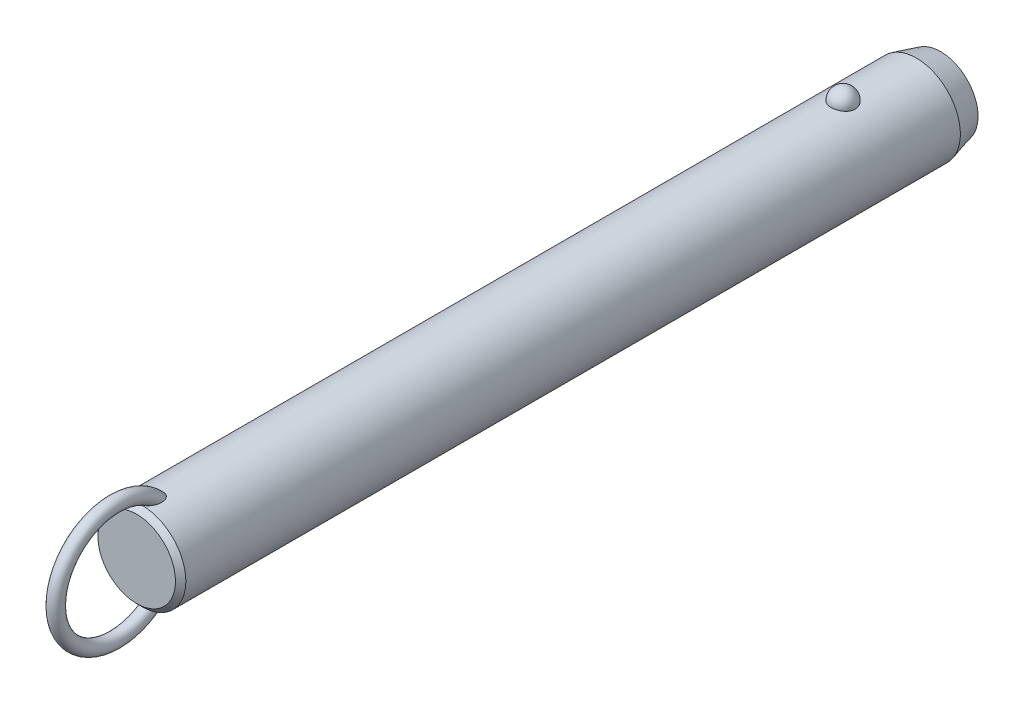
ISO-10303-21;
HEADER;
FILE_DESCRIPTION(('STEP AP214'),'2;1');
FILE_NAME('part.step','',(''),(''),'','','');
FILE_SCHEMA(('AUTOMOTIVE_DESIGN { 1 0 10303 214 1 1 1 1 }'));
ENDSEC;
DATA;
#1=APPLICATION_CONTEXT('core data for automotive mechanical design processes');
#2=APPLICATION_PROTOCOL_DEFINITION('international standard','automotive_design',2000,#1);
#3=PRODUCT_CONTEXT('',#1,'mechanical');
#4=PRODUCT('Part','Part','',(#3));
#5=PRODUCT_RELATED_PRODUCT_CATEGORY('part','',(#4));
#6=PRODUCT_DEFINITION_FORMATION('','',#4);
#7=PRODUCT_DEFINITION_CONTEXT('part definition',#1,'design');
#8=PRODUCT_DEFINITION('design','',#6,#7);
#9=PRODUCT_DEFINITION_SHAPE('','',#8);
#10=(LENGTH_UNIT() NAMED_UNIT(*) SI_UNIT(.MILLI.,.METRE.));
#11=(NAMED_UNIT(*) PLANE_ANGLE_UNIT() SI_UNIT($,.RADIAN.));
#12=(NAMED_UNIT(*) SI_UNIT($,.STERADIAN.) SOLID_ANGLE_UNIT());
#13=UNCERTAINTY_MEASURE_WITH_UNIT(LENGTH_MEASURE(1.E-05),#10,'distance_accuracy_value','');
#14=(GEOMETRIC_REPRESENTATION_CONTEXT(3) GLOBAL_UNCERTAINTY_ASSIGNED_CONTEXT((#13)) GLOBAL_UNIT_ASSIGNED_CONTEXT((#10,
#11,#12)) REPRESENTATION_CONTEXT('',''));
#15=CARTESIAN_POINT('',(0.,0.,0.));
#16=DIRECTION('',(0.,0.,1.));
#17=DIRECTION('',(1.,0.,0.));
#18=AXIS2_PLACEMENT_3D('',#15,#16,#17);
#19=CARTESIAN_POINT('',(0.,0.,188.));
#20=DIRECTION('',(0.,0.,-1.));
#21=DIRECTION('',(-1.,0.,0.));
#22=AXIS2_PLACEMENT_3D('',#19,#20,#21);
#23=CYLINDRICAL_SURFACE('',#22,12.7);
#24=CARTESIAN_POINT('',(3.46661256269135,12.2177165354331,-3.50000000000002));
#25=CARTESIAN_POINT('',(3.4666090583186,12.2177194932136,-3.30432790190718));
#26=CARTESIAN_POINT('',(3.45063567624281,12.2222841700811,-3.10861112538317));
#27=CARTESIAN_POINT('',(3.38712451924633,12.2400345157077,-2.72271899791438));
#28=CARTESIAN_POINT('',(3.33957415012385,12.2532236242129,-2.53254588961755));
#29=CARTESIAN_POINT('',(3.2141234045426,12.286724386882,-2.16324948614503));
#30=CARTESIAN_POINT('',(3.13623639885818,12.3070329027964,-1.98412136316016));
#31=CARTESIAN_POINT('',(2.95205930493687,12.3525018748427,-1.6418059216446));
#32=CARTESIAN_POINT('',(2.84577003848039,12.3776621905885,-1.47861814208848));
#33=CARTESIAN_POINT('',(2.60688050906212,12.4301712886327,-1.17190583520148));
#34=CARTESIAN_POINT('',(2.47415697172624,12.4575299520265,-1.0284789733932));
#35=CARTESIAN_POINT('',(2.18615174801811,12.5112810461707,-0.766177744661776));
#36=CARTESIAN_POINT('',(2.03087002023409,12.5376734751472,-0.647303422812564));
#37=CARTESIAN_POINT('',(1.70237334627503,12.5864761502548,-0.437732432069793));
#38=CARTESIAN_POINT('',(1.52920948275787,12.6088972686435,-0.346958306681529));
#39=CARTESIAN_POINT('',(1.16944170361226,12.6473352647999,-0.195750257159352));
#40=CARTESIAN_POINT('',(0.982839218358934,12.663352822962,-0.135313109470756));
#41=CARTESIAN_POINT('',(0.604961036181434,12.6869706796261,-0.0473241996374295));
#42=CARTESIAN_POINT('',(0.41382314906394,12.6947125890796,-0.0192185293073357));
#43=CARTESIAN_POINT('',(0.0293827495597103,12.7014203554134,0.00517254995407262));
#44=CARTESIAN_POINT('',(-0.163919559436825,12.7003870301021,0.00146092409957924));
#45=CARTESIAN_POINT('',(-0.544374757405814,12.689735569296,-0.0373939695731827));
#46=CARTESIAN_POINT('',(-0.731575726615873,12.6802364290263,-0.0721015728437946));
#47=CARTESIAN_POINT('',(-1.09733277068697,12.6538333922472,-0.171364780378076));
#48=CARTESIAN_POINT('',(-1.27588869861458,12.6369293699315,-0.235920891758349));
#49=CARTESIAN_POINT('',(-1.6204698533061,12.5973946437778,-0.393548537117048));
#50=CARTESIAN_POINT('',(-1.78641865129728,12.5747321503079,-0.486778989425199));
#51=CARTESIAN_POINT('',(-2.10030671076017,12.5261316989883,-0.699110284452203));
#52=CARTESIAN_POINT('',(-2.24824419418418,12.5001934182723,-0.818213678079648));
#53=CARTESIAN_POINT('',(-2.52491489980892,12.4472906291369,-1.0815712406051));
#54=CARTESIAN_POINT('',(-2.65324222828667,12.4203160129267,-1.22624992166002));
#55=CARTESIAN_POINT('',(-2.88410007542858,12.3687509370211,-1.53528325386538));
#56=CARTESIAN_POINT('',(-2.98662883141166,12.3441606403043,-1.69963924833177));
#57=CARTESIAN_POINT('',(-3.16432417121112,12.2998199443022,-2.04548497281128));
#58=CARTESIAN_POINT('',(-3.23917525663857,12.2801261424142,-2.22714424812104));
#59=CARTESIAN_POINT('',(-3.35800573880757,12.248167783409,-2.60091389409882));
#60=CARTESIAN_POINT('',(-3.4019860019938,12.2359030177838,-2.79302397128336));
#61=CARTESIAN_POINT('',(-3.45784812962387,12.2202347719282,-3.18140279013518));
#62=CARTESIAN_POINT('',(-3.46986123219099,12.2167950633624,-3.37765118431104));
#63=CARTESIAN_POINT('',(-3.46186273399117,12.2190638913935,-3.76943689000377));
#64=CARTESIAN_POINT('',(-3.44185196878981,12.2247721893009,-3.96497421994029));
#65=CARTESIAN_POINT('',(-3.37048652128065,12.2446381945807,-4.34881728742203));
#66=CARTESIAN_POINT('',(-3.31928253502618,12.2587552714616,-4.53715319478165));
#67=CARTESIAN_POINT('',(-3.18693461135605,12.2938237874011,-4.9023172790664));
#68=CARTESIAN_POINT('',(-3.1057895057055,12.3147754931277,-5.07914500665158));
#69=CARTESIAN_POINT('',(-2.91506431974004,12.3613125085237,-5.41732059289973));
#70=CARTESIAN_POINT('',(-2.80533587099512,12.3869217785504,-5.57858147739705));
#71=CARTESIAN_POINT('',(-2.560414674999,12.4398525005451,-5.88013283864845));
#72=CARTESIAN_POINT('',(-2.42522099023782,12.4671740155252,-6.02042254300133));
#73=CARTESIAN_POINT('',(-2.1323357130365,12.5205965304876,-6.27662798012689));
#74=CARTESIAN_POINT('',(-1.97456596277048,12.5466928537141,-6.39245542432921));
#75=CARTESIAN_POINT('',(-1.64115839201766,12.5946384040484,-6.59583547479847));
#76=CARTESIAN_POINT('',(-1.46552179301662,12.6164879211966,-6.68339001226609));
#77=CARTESIAN_POINT('',(-1.10356050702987,12.6532533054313,-6.82682153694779));
#78=CARTESIAN_POINT('',(-0.9173913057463,12.6682500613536,-6.88306988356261));
#79=CARTESIAN_POINT('',(-0.537836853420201,12.6900288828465,-6.96386887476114));
#80=CARTESIAN_POINT('',(-0.344452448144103,12.6968119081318,-6.98842322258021));
#81=CARTESIAN_POINT('',(0.0402577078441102,12.7013667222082,-7.00496469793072));
#82=CARTESIAN_POINT('',(0.231556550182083,12.6993008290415,-6.99753844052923));
#83=CARTESIAN_POINT('',(0.610105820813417,12.6867505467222,-6.95166366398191));
#84=CARTESIAN_POINT('',(0.797356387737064,12.6762664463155,-6.91321620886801));
#85=CARTESIAN_POINT('',(1.16186657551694,12.6480587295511,-6.80658431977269));
#86=CARTESIAN_POINT('',(1.33915951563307,12.6303611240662,-6.73850666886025));
#87=CARTESIAN_POINT('',(1.67968518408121,12.5896027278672,-6.57450875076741));
#88=CARTESIAN_POINT('',(1.84291705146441,12.5665416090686,-6.47858678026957));
#89=CARTESIAN_POINT('',(2.15340192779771,12.5171072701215,-6.25982455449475));
#90=CARTESIAN_POINT('',(2.30037831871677,12.4906895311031,-6.13660186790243));
#91=CARTESIAN_POINT('',(2.5717412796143,12.4376567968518,-5.86739587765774));
#92=CARTESIAN_POINT('',(2.69612388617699,12.4110417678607,-5.72140858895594));
#93=CARTESIAN_POINT('',(2.92107785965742,12.360051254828,-5.40794137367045));
#94=CARTESIAN_POINT('',(3.02121329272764,12.3357209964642,-5.24014110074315));
#95=CARTESIAN_POINT('',(3.19236291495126,12.2925446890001,-4.88969865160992));
#96=CARTESIAN_POINT('',(3.26338839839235,12.2736965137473,-4.70706226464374));
#97=CARTESIAN_POINT('',(3.36788038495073,12.245404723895,-4.35469510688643));
#98=CARTESIAN_POINT('',(3.40484026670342,12.2351018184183,-4.18605935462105));
#99=CARTESIAN_POINT('',(3.45420764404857,12.2212564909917,-3.84496058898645));
#100=CARTESIAN_POINT('',(3.46661565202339,12.2177139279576,-3.67249765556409));
#101=CARTESIAN_POINT('',(3.46661256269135,12.2177165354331,-3.50000000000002));
#102=B_SPLINE_CURVE_WITH_KNOTS('',3,(#24,#25,#26,#27,#28,#29,#30,#31,#32,#33,#34,#35,#36,#37,
#38,#39,#40,#41,#42,#43,#44,#45,#46,#47,#48,#49,#50,#51,#52,#53,#54,#55,#56,#57,#58,#59,#60,#61,
#62,#63,#64,#65,#66,#67,#68,#69,#70,#71,#72,#73,#74,#75,#76,#77,#78,#79,#80,#81,#82,#83,#84,#85,
#86,#87,#88,#89,#90,#91,#92,#93,#94,#95,#96,#97,#98,#99,#100,#101),.UNSPECIFIED.,.T.,.F.,(4,2,2,
2,2,2,2,2,2,2,2,2,2,2,2,2,2,2,2,2,2,2,2,2,2,2,2,2,2,2,2,2,2,2,2,2,2,2,4),(0.,0.586396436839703,
1.17302689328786,1.7593990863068,2.34575431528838,2.93491084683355,3.52406845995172,
4.11158733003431,4.69904375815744,5.2762784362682,5.85345931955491,6.42265312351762,
6.99185659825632,7.56427334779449,8.136746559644,8.71981013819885,9.3029135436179,
9.89247258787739,10.4820150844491,11.0691335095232,11.6562366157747,12.2405256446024,
12.8248374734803,13.412244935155,13.9996740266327,14.5891883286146,15.1786623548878,
15.7609861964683,16.3432419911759,16.9148635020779,17.4864654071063,18.0560241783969,
18.6256177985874,19.2037609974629,19.7820055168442,20.3699810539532,20.957728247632,
21.4746855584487,21.9916320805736),.UNSPECIFIED.);
#103=CARTESIAN_POINT('',(3.46661256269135,12.2177165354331,-3.50000000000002));
#104=VERTEX_POINT('',#103);
#105=EDGE_CURVE('E41',#104,#104,#102,.T.);
#106=ORIENTED_EDGE('',*,*,#105,.T.);
#107=EDGE_LOOP('',(#106));
#108=FACE_BOUND('',#107,.T.);
#109=CARTESIAN_POINT('',(0.,0.,199.2));
#110=DIRECTION('',(0.,0.,1.));
#111=DIRECTION('',(1.,0.,0.));
#112=AXIS2_PLACEMENT_3D('',#109,#110,#111);
#113=CIRCLE('',#112,12.7);
#114=CARTESIAN_POINT('',(12.7,0.,199.2));
#115=VERTEX_POINT('',#114);
#116=EDGE_CURVE('E10',#115,#115,#113,.F.);
#117=ORIENTED_EDGE('',*,*,#116,.T.);
#118=EDGE_LOOP('',(#117));
#119=FACE_BOUND('',#118,.T.);
#120=CARTESIAN_POINT('',(-0.548122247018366,-12.6881662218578,192.943218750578));
#121=CARTESIAN_POINT('',(-0.648865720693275,-12.6838128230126,192.977926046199));
#122=CARTESIAN_POINT('',(-0.746398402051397,-12.6783867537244,193.022042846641));
#123=CARTESIAN_POINT('',(-0.932125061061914,-12.666091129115,193.126764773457));
#124=CARTESIAN_POINT('',(-1.02030388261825,-12.6592192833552,193.187396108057));
#125=CARTESIAN_POINT('',(-1.18487740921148,-12.6448747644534,193.321847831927));
#126=CARTESIAN_POINT('',(-1.26134296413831,-12.637406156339,193.395582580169));
#127=CARTESIAN_POINT('',(-1.4023120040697,-12.6225412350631,193.553604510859));
#128=CARTESIAN_POINT('',(-1.466814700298,-12.6151449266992,193.63789238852));
#129=CARTESIAN_POINT('',(-1.60714786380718,-12.5981718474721,193.849657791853));
#130=CARTESIAN_POINT('',(-1.67725126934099,-12.588900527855,193.980962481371));
#131=CARTESIAN_POINT('',(-1.79536591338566,-12.5725964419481,194.253247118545));
#132=CARTESIAN_POINT('',(-1.84333535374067,-12.5655679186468,194.394244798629));
#133=CARTESIAN_POINT('',(-1.93422576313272,-12.5519624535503,194.737645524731));
#134=CARTESIAN_POINT('',(-1.96788773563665,-12.5466298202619,194.942557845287));
#135=CARTESIAN_POINT('',(-1.9941399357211,-12.542463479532,195.251760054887));
#136=CARTESIAN_POINT('',(-1.99883864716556,-12.5417153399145,195.355298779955));
#137=CARTESIAN_POINT('',(-2.00078003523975,-12.5414074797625,195.56245124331));
#138=CARTESIAN_POINT('',(-1.99802449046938,-12.5418474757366,195.666064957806));
#139=CARTESIAN_POINT('',(-1.98336733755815,-12.5441750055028,195.91032076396));
#140=CARTESIAN_POINT('',(-1.96851430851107,-12.5465291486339,196.050780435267));
#141=CARTESIAN_POINT('',(-1.92707089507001,-12.5529612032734,196.329960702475));
#142=CARTESIAN_POINT('',(-1.90047458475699,-12.5570399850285,196.468680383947));
#143=CARTESIAN_POINT('',(-1.8361912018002,-12.5666008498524,196.74341135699));
#144=CARTESIAN_POINT('',(-1.79850828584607,-12.57208240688,196.879423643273));
#145=CARTESIAN_POINT('',(-1.71223796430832,-12.5841228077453,197.147842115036));
#146=CARTESIAN_POINT('',(-1.66365679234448,-12.5906810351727,197.280250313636));
#147=CARTESIAN_POINT('',(-1.5780450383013,-12.6016176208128,197.48548877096));
#148=CARTESIAN_POINT('',(-1.54477252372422,-12.6057501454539,197.559914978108));
#149=CARTESIAN_POINT('',(-1.47424480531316,-12.6141930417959,197.706839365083));
#150=CARTESIAN_POINT('',(-1.436990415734,-12.6185033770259,197.779337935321));
#151=CARTESIAN_POINT('',(-1.35825795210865,-12.6272207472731,197.921892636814));
#152=CARTESIAN_POINT('',(-1.31678520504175,-12.6316276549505,197.991951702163));
#153=CARTESIAN_POINT('',(-1.22917793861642,-12.6404532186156,198.129070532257));
#154=CARTESIAN_POINT('',(-1.18304514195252,-12.6448718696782,198.196131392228));
#155=CARTESIAN_POINT('',(-1.07246411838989,-12.6547893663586,198.343874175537));
#156=CARTESIAN_POINT('',(-1.00642239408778,-12.6602600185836,198.423384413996));
#157=CARTESIAN_POINT('',(-0.86444142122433,-12.6707460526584,198.573169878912));
#158=CARTESIAN_POINT('',(-0.788516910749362,-12.6757620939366,198.643458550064));
#159=CARTESIAN_POINT('',(-0.652215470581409,-12.6833591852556,198.748680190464));
#160=CARTESIAN_POINT('',(-0.59498203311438,-12.6861973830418,198.787624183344));
#161=CARTESIAN_POINT('',(-0.475269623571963,-12.6912445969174,198.856489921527));
#162=CARTESIAN_POINT('',(-0.412800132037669,-12.6934547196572,198.886427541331));
#163=CARTESIAN_POINT('',(-0.295749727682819,-12.6966636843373,198.92975652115));
#164=CARTESIAN_POINT('',(-0.241949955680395,-12.6978134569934,198.945218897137));
#165=CARTESIAN_POINT('',(-0.132508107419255,-12.6994261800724,198.966884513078));
#166=CARTESIAN_POINT('',(-0.0768679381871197,-12.6998898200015,198.973097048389));
#167=CARTESIAN_POINT('',(0.03476966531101,-12.7000752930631,198.975583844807));
#168=CARTESIAN_POINT('',(0.0907676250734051,-12.6997954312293,198.971835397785));
#169=CARTESIAN_POINT('',(0.201283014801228,-12.6985255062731,198.954788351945));
#170=CARTESIAN_POINT('',(0.255799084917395,-12.6975348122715,198.941481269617));
#171=CARTESIAN_POINT('',(0.376042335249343,-12.6946091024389,198.90203792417));
#172=CARTESIAN_POINT('',(0.440950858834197,-12.6924943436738,198.873449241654));
#173=CARTESIAN_POINT('',(0.565350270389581,-12.6875639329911,198.806323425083));
#174=CARTESIAN_POINT('',(0.624828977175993,-12.6847467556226,198.767764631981));
#175=CARTESIAN_POINT('',(0.774116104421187,-12.6767252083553,198.656949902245));
#176=CARTESIAN_POINT('',(0.859449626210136,-12.6711344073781,198.578760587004));
#177=CARTESIAN_POINT('',(1.01789440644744,-12.6593922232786,198.410943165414));
#178=CARTESIAN_POINT('',(1.09096902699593,-12.653239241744,198.321282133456));
#179=CARTESIAN_POINT('',(1.22268793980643,-12.6411674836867,198.140265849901));
#180=CARTESIAN_POINT('',(1.28193986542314,-12.6352572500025,198.049345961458));
#181=CARTESIAN_POINT('',(1.39259777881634,-12.6235401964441,197.862792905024));
#182=CARTESIAN_POINT('',(1.44399707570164,-12.6177334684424,197.767155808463));
#183=CARTESIAN_POINT('',(1.53972870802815,-12.6064093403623,197.572273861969));
#184=CARTESIAN_POINT('',(1.58405262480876,-12.6008922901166,197.473024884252));
#185=CARTESIAN_POINT('',(1.66600705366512,-12.5903187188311,197.271772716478));
#186=CARTESIAN_POINT('',(1.7036365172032,-12.5852622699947,197.169769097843));
#187=CARTESIAN_POINT('',(1.77545379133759,-12.5753406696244,196.954358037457));
#188=CARTESIAN_POINT('',(1.80903453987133,-12.5705328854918,196.840745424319));
#189=CARTESIAN_POINT('',(1.86844163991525,-12.5618400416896,196.611457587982));
#190=CARTESIAN_POINT('',(1.89426665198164,-12.5579551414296,196.495782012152));
#191=CARTESIAN_POINT('',(1.9378546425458,-12.5513030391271,196.263007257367));
#192=CARTESIAN_POINT('',(1.9556264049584,-12.5485346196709,196.145909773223));
#193=CARTESIAN_POINT('',(1.98264463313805,-12.5442934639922,195.910747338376));
#194=CARTESIAN_POINT('',(1.99189298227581,-12.5428204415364,195.79268260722));
#195=CARTESIAN_POINT('',(2.00416068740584,-12.540871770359,195.480622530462));
#196=CARTESIAN_POINT('',(1.99944433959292,-12.541631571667,195.286229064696));
#197=CARTESIAN_POINT('',(1.96113755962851,-12.5476846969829,194.900309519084));
#198=CARTESIAN_POINT('',(1.92758341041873,-12.5529723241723,194.708780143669));
#199=CARTESIAN_POINT('',(1.83934342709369,-12.5661532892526,194.382272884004));
#200=CARTESIAN_POINT('',(1.79215440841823,-12.5730485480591,194.24524997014));
#201=CARTESIAN_POINT('',(1.67676242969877,-12.588958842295,193.980445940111));
#202=CARTESIAN_POINT('',(1.60859050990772,-12.597970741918,193.852651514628));
#203=CARTESIAN_POINT('',(1.46583832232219,-12.6152829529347,193.635800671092));
#204=CARTESIAN_POINT('',(1.39525727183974,-12.6233659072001,193.54410500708));
#205=CARTESIAN_POINT('',(1.23992594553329,-12.6395676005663,193.373485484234));
#206=CARTESIAN_POINT('',(1.15517932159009,-12.6476863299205,193.294558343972));
#207=CARTESIAN_POINT('',(0.971995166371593,-12.6630846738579,193.152643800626));
#208=CARTESIAN_POINT('',(0.873456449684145,-12.6703572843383,193.089784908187));
#209=CARTESIAN_POINT('',(0.665847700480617,-12.6829569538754,192.984487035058));
#210=CARTESIAN_POINT('',(0.556784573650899,-12.688285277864,192.942034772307));
#211=CARTESIAN_POINT('',(0.347338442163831,-12.6956226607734,192.884443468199));
#212=CARTESIAN_POINT('',(0.247759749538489,-12.6979816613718,192.866399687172));
#213=CARTESIAN_POINT('',(0.0470218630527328,-12.7003077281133,192.848600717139));
#214=CARTESIAN_POINT('',(-0.0541350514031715,-12.7002779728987,192.848821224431));
#215=CARTESIAN_POINT('',(-0.221414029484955,-12.6982482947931,192.864363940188));
#216=CARTESIAN_POINT('',(-0.288055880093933,-12.6969033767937,192.874666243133));
#217=CARTESIAN_POINT('',(-0.419599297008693,-12.6932369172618,192.90313489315));
#218=CARTESIAN_POINT('',(-0.484501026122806,-12.6909154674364,192.921300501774));
#219=CARTESIAN_POINT('',(-0.548122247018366,-12.6881662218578,192.943218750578));
#220=B_SPLINE_CURVE_WITH_KNOTS('',3,(#120,#121,#122,#123,#124,#125,#126,#127,#128,#129,#130,
#131,#132,#133,#134,#135,#136,#137,#138,#139,#140,#141,#142,#143,#144,#145,#146,#147,#148,#149,
#150,#151,#152,#153,#154,#155,#156,#157,#158,#159,#160,#161,#162,#163,#164,#165,#166,#167,#168,
#169,#170,#171,#172,#173,#174,#175,#176,#177,#178,#179,#180,#181,#182,#183,#184,#185,#186,#187,
#188,#189,#190,#191,#192,#193,#194,#195,#196,#197,#198,#199,#200,#201,#202,#203,#204,#205,#206,
#207,#208,#209,#210,#211,#212,#213,#214,#215,#216,#217,#218,#219),.UNSPECIFIED.,.T.,.F.,(4,2,2,
2,2,2,2,2,2,2,2,2,2,2,2,2,2,2,2,2,2,2,2,2,2,2,2,2,2,2,2,2,2,2,2,2,2,2,2,2,2,2,2,2,2,2,2,2,2,4),
(0.,0.31964225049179,0.639794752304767,0.957927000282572,1.27608021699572,1.72100165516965,
2.16675988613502,2.78630021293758,3.09705782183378,3.40774128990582,3.8309635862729,
4.25439969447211,4.67767724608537,5.10071330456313,5.34550297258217,5.59024267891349,
5.83467707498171,6.07902143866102,6.38891080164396,6.69834321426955,6.9056091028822,
7.11250749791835,7.27977315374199,7.44687060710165,7.61434932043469,7.78197685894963,
7.99365544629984,8.20579780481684,8.55147335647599,8.89816429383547,9.22375138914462,
9.54961437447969,9.87586224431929,10.202161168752,10.557587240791,10.9130746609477,
11.2681734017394,11.6231936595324,12.2046601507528,12.7853961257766,13.219164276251,
13.6522938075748,13.9989174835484,14.3454519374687,14.6946768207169,15.0436740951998,
15.3457513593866,15.6474266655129,15.8493051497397,16.0511646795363),.UNSPECIFIED.);
#221=CARTESIAN_POINT('',(-0.548122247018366,-12.6881662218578,192.943218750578));
#222=VERTEX_POINT('',#221);
#223=EDGE_CURVE('E59',#222,#222,#220,.T.);
#224=ORIENTED_EDGE('',*,*,#223,.T.);
#225=EDGE_LOOP('',(#224));
#226=FACE_BOUND('',#225,.T.);
#227=CARTESIAN_POINT('',(-0.548122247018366,12.6881662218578,192.943218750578));
#228=CARTESIAN_POINT('',(-0.459436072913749,12.6919968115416,192.912673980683));
#229=CARTESIAN_POINT('',(-0.368189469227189,12.6949996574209,192.889391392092));
#230=CARTESIAN_POINT('',(-0.18302400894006,12.6990186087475,192.858406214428));
#231=CARTESIAN_POINT('',(-0.0891049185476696,12.7000345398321,192.850704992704));
#232=CARTESIAN_POINT('',(0.0987147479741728,12.6999636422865,192.851245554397));
#233=CARTESIAN_POINT('',(0.192615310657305,12.6988761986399,192.859492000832));
#234=CARTESIAN_POINT('',(0.377658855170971,12.6947211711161,192.891551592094));
#235=CARTESIAN_POINT('',(0.468801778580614,12.6916535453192,192.915365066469));
#236=CARTESIAN_POINT('',(0.645809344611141,12.6838788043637,192.97745651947));
#237=CARTESIAN_POINT('',(0.731679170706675,12.6791733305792,193.015720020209));
#238=CARTESIAN_POINT('',(0.896315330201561,12.6686004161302,193.105120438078));
#239=CARTESIAN_POINT('',(0.975080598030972,12.6627328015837,193.156259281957));
#240=CARTESIAN_POINT('',(1.12963655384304,12.6499161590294,193.27367820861));
#241=CARTESIAN_POINT('',(1.20478673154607,12.6429194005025,193.340792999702));
#242=CARTESIAN_POINT('',(1.34448241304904,12.6288282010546,193.48522507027));
#243=CARTESIAN_POINT('',(1.40902173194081,12.621733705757,193.562548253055));
#244=CARTESIAN_POINT('',(1.55208211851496,12.6050877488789,193.759247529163));
#245=CARTESIAN_POINT('',(1.62510490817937,12.5957546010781,193.882654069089));
#246=CARTESIAN_POINT('',(1.7501904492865,12.5789823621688,194.139769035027));
#247=CARTESIAN_POINT('',(1.80221377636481,12.5715468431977,194.273496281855));
#248=CARTESIAN_POINT('',(1.90309965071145,12.5567434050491,194.598351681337));
#249=CARTESIAN_POINT('',(1.94342317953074,12.5504515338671,194.792161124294));
#250=CARTESIAN_POINT('',(1.99332997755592,12.5426147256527,195.18378810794));
#251=CARTESIAN_POINT('',(2.00285305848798,12.5410790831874,195.381612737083));
#252=CARTESIAN_POINT('',(1.99678999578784,12.5420407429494,195.716642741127));
#253=CARTESIAN_POINT('',(1.98794117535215,12.5434564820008,195.854042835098));
#254=CARTESIAN_POINT('',(1.95865119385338,12.5480641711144,196.127639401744));
#255=CARTESIAN_POINT('',(1.93820436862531,12.5512569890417,196.263835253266));
#256=CARTESIAN_POINT('',(1.88647896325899,12.5591352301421,196.534249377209));
#257=CARTESIAN_POINT('',(1.85518800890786,12.5638223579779,196.668465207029));
#258=CARTESIAN_POINT('',(1.78217886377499,12.5743868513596,196.933936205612));
#259=CARTESIAN_POINT('',(1.74046509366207,12.5802637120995,197.065192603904));
#260=CARTESIAN_POINT('',(1.66024095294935,12.5910571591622,197.286085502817));
#261=CARTESIAN_POINT('',(1.62434772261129,12.5957535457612,197.376690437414));
#262=CARTESIAN_POINT('',(1.54709009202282,12.6054762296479,197.555512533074));
#263=CARTESIAN_POINT('',(1.50572681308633,12.6105024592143,197.643730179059));
#264=CARTESIAN_POINT('',(1.41728020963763,12.620748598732,197.816932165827));
#265=CARTESIAN_POINT('',(1.37021377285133,12.625967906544,197.901925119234));
#266=CARTESIAN_POINT('',(1.26969620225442,12.6364721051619,198.068007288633));
#267=CARTESIAN_POINT('',(1.21624929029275,12.6417569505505,198.149099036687));
#268=CARTESIAN_POINT('',(1.10304413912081,12.6521331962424,198.304702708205));
#269=CARTESIAN_POINT('',(1.04340936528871,12.657226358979,198.379303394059));
#270=CARTESIAN_POINT('',(0.915919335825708,12.667090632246,198.521324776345));
#271=CARTESIAN_POINT('',(0.848064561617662,12.6718617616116,198.58874589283));
#272=CARTESIAN_POINT('',(0.717035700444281,12.67987711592,198.700624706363));
#273=CARTESIAN_POINT('',(0.655526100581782,12.6832377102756,198.746997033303));
#274=CARTESIAN_POINT('',(0.525985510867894,12.6892676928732,198.829619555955));
#275=CARTESIAN_POINT('',(0.457969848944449,12.6919386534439,198.865892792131));
#276=CARTESIAN_POINT('',(0.334859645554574,12.695691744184,198.916657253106));
#277=CARTESIAN_POINT('',(0.281116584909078,12.6970073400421,198.934373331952));
#278=CARTESIAN_POINT('',(0.171425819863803,12.6989609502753,198.960642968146));
#279=CARTESIAN_POINT('',(0.115480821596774,12.699599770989,198.969207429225));
#280=CARTESIAN_POINT('',(0.00272618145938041,12.7001251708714,198.976253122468));
#281=CARTESIAN_POINT('',(-0.0540859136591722,12.7000089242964,198.974696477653));
#282=CARTESIAN_POINT('',(-0.16654462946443,12.6990328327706,198.961600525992));
#283=CARTESIAN_POINT('',(-0.222190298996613,12.6981724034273,198.950053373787));
#284=CARTESIAN_POINT('',(-0.342018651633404,12.695562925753,198.914912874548));
#285=CARTESIAN_POINT('',(-0.405606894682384,12.6936676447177,198.88933225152));
#286=CARTESIAN_POINT('',(-0.527815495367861,12.6891754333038,198.828311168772));
#287=CARTESIAN_POINT('',(-0.586425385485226,12.6865770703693,198.792850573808));
#288=CARTESIAN_POINT('',(-0.731842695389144,12.6792129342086,198.691496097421));
#289=CARTESIAN_POINT('',(-0.81470941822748,12.6740767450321,198.6200395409));
#290=CARTESIAN_POINT('',(-0.969101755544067,12.6632083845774,198.46589007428));
#291=CARTESIAN_POINT('',(-1.04059564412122,12.6574746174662,198.383166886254));
#292=CARTESIAN_POINT('',(-1.16981116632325,12.6461638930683,198.215809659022));
#293=CARTESIAN_POINT('',(-1.22811369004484,12.6405994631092,198.131616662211));
#294=CARTESIAN_POINT('',(-1.33743405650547,12.6295007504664,197.958579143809));
#295=CARTESIAN_POINT('',(-1.38844577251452,12.6239664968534,197.869730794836));
#296=CARTESIAN_POINT('',(-1.48400702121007,12.6130898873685,197.688389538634));
#297=CARTESIAN_POINT('',(-1.52854232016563,12.6077479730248,197.595889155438));
#298=CARTESIAN_POINT('',(-1.61150113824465,12.5974127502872,197.408160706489));
#299=CARTESIAN_POINT('',(-1.64992317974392,12.5924195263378,197.312931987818));
#300=CARTESIAN_POINT('',(-1.73468589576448,12.581070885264,197.08289362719));
#301=CARTESIAN_POINT('',(-1.77831261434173,12.5749388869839,196.947066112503));
#302=CARTESIAN_POINT('',(-1.85439734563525,12.5639437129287,196.672212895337));
#303=CARTESIAN_POINT('',(-1.88684994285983,12.5590811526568,196.533185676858));
#304=CARTESIAN_POINT('',(-1.94008483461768,12.550968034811,196.25309235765));
#305=CARTESIAN_POINT('',(-1.96088706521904,12.5477147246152,196.112030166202));
#306=CARTESIAN_POINT('',(-1.99000539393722,12.5431291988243,195.828668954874));
#307=CARTESIAN_POINT('',(-1.99832911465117,12.5417958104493,195.686370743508));
#308=CARTESIAN_POINT('',(-2.00166624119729,12.5412674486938,195.357627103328));
#309=CARTESIAN_POINT('',(-1.99178843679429,12.5428579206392,195.171088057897));
#310=CARTESIAN_POINT('',(-1.94455183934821,12.5502731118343,194.80162404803));
#311=CARTESIAN_POINT('',(-1.90724032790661,12.5560905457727,194.618693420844));
#312=CARTESIAN_POINT('',(-1.81330718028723,12.5699462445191,194.304848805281));
#313=CARTESIAN_POINT('',(-1.76338820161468,12.5771273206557,194.171910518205));
#314=CARTESIAN_POINT('',(-1.64305018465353,12.593414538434,193.915681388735));
#315=CARTESIAN_POINT('',(-1.57265346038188,12.6025185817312,193.792380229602));
#316=CARTESIAN_POINT('',(-1.42634956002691,12.6198178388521,193.583564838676));
#317=CARTESIAN_POINT('',(-1.35423772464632,12.6278405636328,193.495384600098));
#318=CARTESIAN_POINT('',(-1.19645664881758,12.6437632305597,193.332107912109));
#319=CARTESIAN_POINT('',(-1.1108053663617,12.6516633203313,193.256994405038));
#320=CARTESIAN_POINT('',(-0.947219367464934,12.6648319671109,193.137811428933));
#321=CARTESIAN_POINT('',(-0.871624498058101,12.670300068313,193.090541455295));
#322=CARTESIAN_POINT('',(-0.714161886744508,12.6801492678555,193.0077413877));
#323=CARTESIAN_POINT('',(-0.632295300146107,12.684530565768,192.97220913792));
#324=CARTESIAN_POINT('',(-0.548122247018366,12.6881662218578,192.943218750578));
#325=B_SPLINE_CURVE_WITH_KNOTS('',3,(#227,#228,#229,#230,#231,#232,#233,#234,#235,#236,#237,
#238,#239,#240,#241,#242,#243,#244,#245,#246,#247,#248,#249,#250,#251,#252,#253,#254,#255,#256,
#257,#258,#259,#260,#261,#262,#263,#264,#265,#266,#267,#268,#269,#270,#271,#272,#273,#274,#275,
#276,#277,#278,#279,#280,#281,#282,#283,#284,#285,#286,#287,#288,#289,#290,#291,#292,#293,#294,
#295,#296,#297,#298,#299,#300,#301,#302,#303,#304,#305,#306,#307,#308,#309,#310,#311,#312,#313,
#314,#315,#316,#317,#318,#319,#320,#321,#322,#323,#324),.UNSPECIFIED.,.T.,.F.,(4,2,2,2,2,2,2,2,
2,2,2,2,2,2,2,2,2,2,2,2,2,2,2,2,2,2,2,2,2,2,2,2,2,2,2,2,2,2,2,2,2,2,2,2,2,2,2,2,4),(0.,
0.281328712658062,0.562682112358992,0.844117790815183,1.12555942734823,1.40671982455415,
1.68792232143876,1.98972294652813,2.29169886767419,2.72039860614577,3.14989948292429,
3.74084916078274,4.33295293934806,4.74554109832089,5.15833092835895,5.57159335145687,
5.98468079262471,6.27722775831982,6.56971484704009,6.86135609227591,7.15280542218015,
7.43927407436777,7.72572595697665,7.95635862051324,8.18646071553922,8.35559393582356,
8.52452541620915,8.69408946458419,8.86378678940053,9.06834348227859,9.27332014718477,
9.60010414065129,9.92778432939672,10.2350252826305,10.5425229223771,10.8506864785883,
11.15892440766,11.5867893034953,12.0148612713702,12.4421984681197,12.8692745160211,
13.4279365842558,13.9856380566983,14.4107062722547,14.835313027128,15.1765567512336,
15.517351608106,15.7844129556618,16.051425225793),.UNSPECIFIED.);
#326=CARTESIAN_POINT('',(-0.548122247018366,12.6881662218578,192.943218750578));
#327=VERTEX_POINT('',#326);
#328=EDGE_CURVE('E67',#327,#327,#325,.T.);
#329=ORIENTED_EDGE('',*,*,#328,.T.);
#330=EDGE_LOOP('',(#329));
#331=FACE_BOUND('',#330,.T.);
#332=CARTESIAN_POINT('',(0.,0.,-24.6999999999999));
#333=DIRECTION('',(0.,0.,-1.));
#334=DIRECTION('',(-1.,0.,0.));
#335=AXIS2_PLACEMENT_3D('',#332,#333,#334);
#336=CIRCLE('',#335,12.7);
#337=CARTESIAN_POINT('',(-12.7,0.,-24.6999999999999));
#338=VERTEX_POINT('',#337);
#339=EDGE_CURVE('E56',#338,#338,#336,.F.);
#340=ORIENTED_EDGE('',*,*,#339,.T.);
#341=EDGE_LOOP('',(#340));
#342=FACE_BOUND('',#341,.T.);
#343=ADVANCED_FACE('F37',(#108,#119,#226,#331,#342),#23,.T.);
#344=CARTESIAN_POINT('',(0.,0.,-31.7));
#345=DIRECTION('',(0.,0.,-1.));
#346=DIRECTION('',(-1.,0.,0.));
#347=AXIS2_PLACEMENT_3D('',#344,#345,#346);
#348=PLANE('',#347);
#349=CARTESIAN_POINT('',(0.,0.,-31.7));
#350=DIRECTION('',(0.,0.,-1.));
#351=DIRECTION('',(-1.,0.,0.));
#352=AXIS2_PLACEMENT_3D('',#349,#350,#351);
#353=CIRCLE('',#352,10.8243556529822);
#354=CARTESIAN_POINT('',(-10.8243556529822,0.,-31.7));
#355=VERTEX_POINT('',#354);
#356=EDGE_CURVE('E66',#355,#355,#353,.T.);
#357=ORIENTED_EDGE('',*,*,#356,.T.);
#358=EDGE_LOOP('',(#357));
#359=FACE_BOUND('',#358,.T.);
#360=ADVANCED_FACE('F85',(#359),#348,.T.);
#361=CARTESIAN_POINT('',(0.,0.,-31.7));
#362=DIRECTION('',(0.,0.,1.));
#363=DIRECTION('',(1.,0.,0.));
#364=AXIS2_PLACEMENT_3D('',#361,#362,#363);
#365=CONICAL_SURFACE('',#364,10.8243556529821,0.261799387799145);
#366=ORIENTED_EDGE('',*,*,#339,.F.);
#367=EDGE_LOOP('',(#366));
#368=FACE_BOUND('',#367,.T.);
#369=ORIENTED_EDGE('',*,*,#356,.F.);
#370=EDGE_LOOP('',(#369));
#371=FACE_BOUND('',#370,.T.);
#372=ADVANCED_FACE('F83',(#368,#371),#365,.T.);
#373=CARTESIAN_POINT('',(0.,0.,200.7));
#374=DIRECTION('',(0.,0.,1.));
#375=DIRECTION('',(1.,0.,0.));
#376=AXIS2_PLACEMENT_3D('',#373,#374,#375);
#377=PLANE('',#376);
#378=CARTESIAN_POINT('',(0.,0.,200.7));
#379=DIRECTION('',(0.,0.,1.));
#380=DIRECTION('',(1.,0.,0.));
#381=AXIS2_PLACEMENT_3D('',#378,#379,#380);
#382=CIRCLE('',#381,11.2000000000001);
#383=CARTESIAN_POINT('',(11.2000000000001,0.,200.7));
#384=VERTEX_POINT('',#383);
#385=EDGE_CURVE('E50',#384,#384,#382,.T.);
#386=ORIENTED_EDGE('',*,*,#385,.T.);
#387=EDGE_LOOP('',(#386));
#388=FACE_BOUND('',#387,.T.);
#389=ADVANCED_FACE('F77',(#388),#377,.T.);
#390=CARTESIAN_POINT('',(0.,0.,207.05));
#391=DIRECTION('',(1.,0.,0.));
#392=DIRECTION('',(0.,0.,-1.));
#393=AXIS2_PLACEMENT_3D('',#390,#391,#392);
#394=TOROIDAL_SURFACE('',#393,17.05,2.);
#395=ORIENTED_EDGE('',*,*,#328,.F.);
#396=EDGE_LOOP('',(#395));
#397=FACE_BOUND('',#396,.T.);
#398=ORIENTED_EDGE('',*,*,#223,.F.);
#399=EDGE_LOOP('',(#398));
#400=FACE_BOUND('',#399,.T.);
#401=ADVANCED_FACE('F73',(#397,#400),#394,.T.);
#402=CARTESIAN_POINT('',(0.,0.,200.7));
#403=DIRECTION('',(0.,0.,-1.));
#404=DIRECTION('',(-1.,0.,0.));
#405=AXIS2_PLACEMENT_3D('',#402,#403,#404);
#406=CONICAL_SURFACE('',#405,11.2000000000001,0.785398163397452);
#407=ORIENTED_EDGE('',*,*,#116,.F.);
#408=EDGE_LOOP('',(#407));
#409=FACE_BOUND('',#408,.T.);
#410=ORIENTED_EDGE('',*,*,#385,.F.);
#411=EDGE_LOOP('',(#410));
#412=FACE_BOUND('',#411,.T.);
#413=ADVANCED_FACE('F39',(#409,#412),#406,.T.);
#414=CARTESIAN_POINT('',(0.,12.7,-3.50000000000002));
#415=DIRECTION('',(0.,1.,0.));
#416=DIRECTION('',(0.,0.,-1.));
#417=AXIS2_PLACEMENT_3D('',#414,#415,#416);
#418=SPHERICAL_SURFACE('',#417,3.5);
#419=ORIENTED_EDGE('',*,*,#105,.F.);
#420=EDGE_LOOP('',(#419));
#421=FACE_BOUND('',#420,.T.);
#422=ADVANCED_FACE('F79',(#421),#418,.T.);
#423=CLOSED_SHELL('',(#343,#360,#372,#389,#401,#413,#422));
#424=MANIFOLD_SOLID_BREP('B2',#423);
#425=ADVANCED_BREP_SHAPE_REPRESENTATION('',(#18,#424),#14);
#426=SHAPE_DEFINITION_REPRESENTATION(#9,#425);
ENDSEC;
END-ISO-10303-21;
